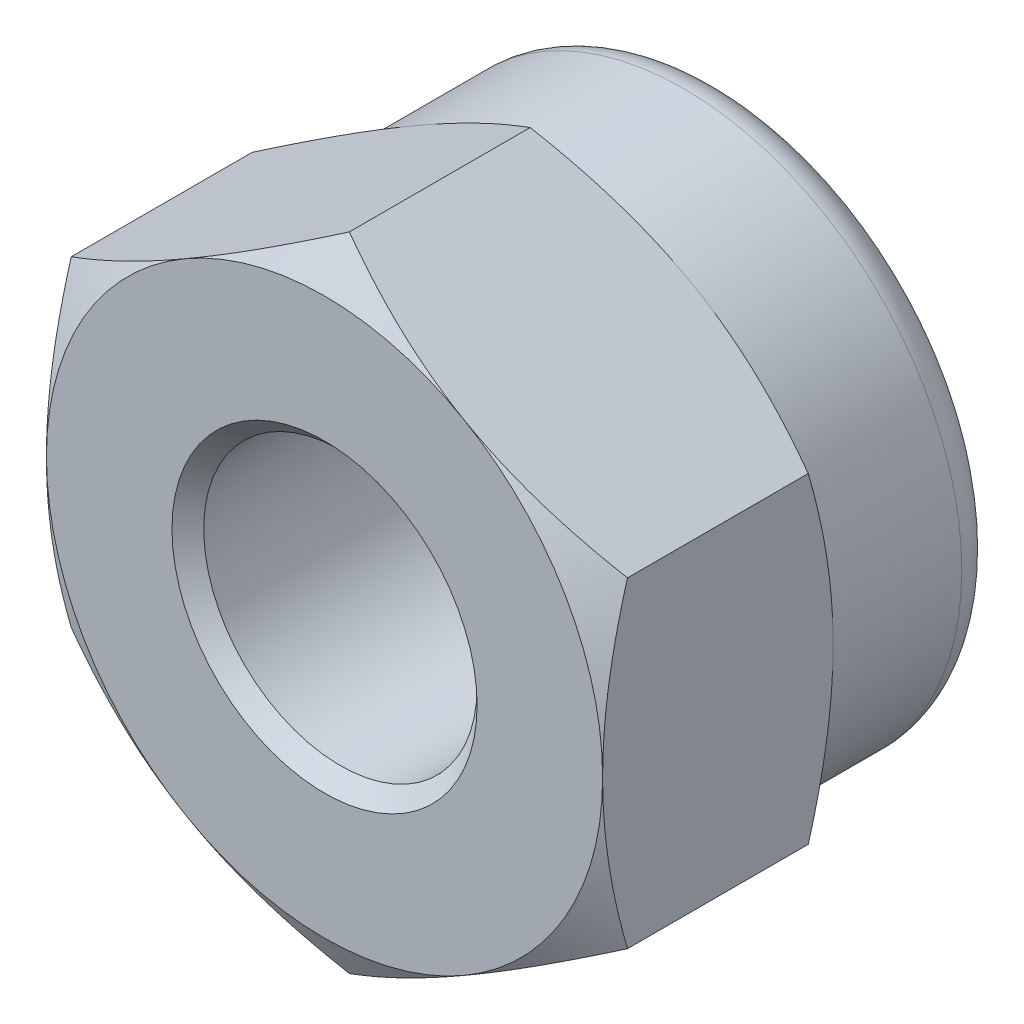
ISO-10303-21;
HEADER;
FILE_DESCRIPTION(('STEP AP214'),'2;1');
FILE_NAME('part.step','',(''),(''),'','','');
FILE_SCHEMA(('AUTOMOTIVE_DESIGN { 1 0 10303 214 1 1 1 1 }'));
ENDSEC;
DATA;
#1=APPLICATION_CONTEXT('core data for automotive mechanical design processes');
#2=APPLICATION_PROTOCOL_DEFINITION('international standard','automotive_design',2000,#1);
#3=PRODUCT_CONTEXT('',#1,'mechanical');
#4=PRODUCT('Part','Part','',(#3));
#5=PRODUCT_RELATED_PRODUCT_CATEGORY('part','',(#4));
#6=PRODUCT_DEFINITION_FORMATION('','',#4);
#7=PRODUCT_DEFINITION_CONTEXT('part definition',#1,'design');
#8=PRODUCT_DEFINITION('design','',#6,#7);
#9=PRODUCT_DEFINITION_SHAPE('','',#8);
#10=(LENGTH_UNIT() NAMED_UNIT(*) SI_UNIT(.MILLI.,.METRE.));
#11=(NAMED_UNIT(*) PLANE_ANGLE_UNIT() SI_UNIT($,.RADIAN.));
#12=(NAMED_UNIT(*) SI_UNIT($,.STERADIAN.) SOLID_ANGLE_UNIT());
#13=UNCERTAINTY_MEASURE_WITH_UNIT(LENGTH_MEASURE(1.E-05),#10,'distance_accuracy_value','');
#14=(GEOMETRIC_REPRESENTATION_CONTEXT(3) GLOBAL_UNCERTAINTY_ASSIGNED_CONTEXT((#13)) GLOBAL_UNIT_ASSIGNED_CONTEXT((#10,
#11,#12)) REPRESENTATION_CONTEXT('',''));
#15=CARTESIAN_POINT('',(0.,0.,0.));
#16=DIRECTION('',(0.,0.,1.));
#17=DIRECTION('',(1.,0.,0.));
#18=AXIS2_PLACEMENT_3D('',#15,#16,#17);
#19=CARTESIAN_POINT('',(0.,0.,-5.));
#20=DIRECTION('',(0.,0.,1.));
#21=DIRECTION('',(1.,0.,0.));
#22=AXIS2_PLACEMENT_3D('',#19,#20,#21);
#23=CYLINDRICAL_SURFACE('',#22,2.2);
#24=CARTESIAN_POINT('',(0.,0.,-2.9));
#25=DIRECTION('',(0.,0.,-1.));
#26=DIRECTION('',(-1.,0.,0.));
#27=AXIS2_PLACEMENT_3D('',#24,#25,#26);
#28=CIRCLE('',#27,2.2);
#29=CARTESIAN_POINT('',(-2.2,0.,-2.9));
#30=VERTEX_POINT('',#29);
#31=EDGE_CURVE('E324',#30,#30,#28,.T.);
#32=ORIENTED_EDGE('',*,*,#31,.F.);
#33=EDGE_LOOP('',(#32));
#34=FACE_BOUND('',#33,.T.);
#35=CARTESIAN_POINT('',(0.,0.,-4.475));
#36=DIRECTION('',(0.,0.,-1.));
#37=DIRECTION('',(-1.,0.,0.));
#38=AXIS2_PLACEMENT_3D('',#35,#36,#37);
#39=CIRCLE('',#38,2.2);
#40=CARTESIAN_POINT('',(-2.2,0.,-4.475));
#41=VERTEX_POINT('',#40);
#42=EDGE_CURVE('E321',#41,#41,#39,.T.);
#43=ORIENTED_EDGE('',*,*,#42,.T.);
#44=EDGE_LOOP('',(#43));
#45=FACE_BOUND('',#44,.T.);
#46=ADVANCED_FACE('F40',(#34,#45),#23,.F.);
#47=CARTESIAN_POINT('',(3.5,2.02072594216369,-2.9));
#48=DIRECTION('',(0.5,0.866025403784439,0.));
#49=DIRECTION('',(-0.866025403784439,0.5,0.));
#50=AXIS2_PLACEMENT_3D('',#47,#48,#49);
#51=PLANE('',#50);
#52=DIRECTION('',(0.,0.,1.));
#53=VECTOR('',#52,1.);
#54=CARTESIAN_POINT('',(3.5,2.02072594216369,-2.9));
#55=LINE('',#54,#53);
#56=CARTESIAN_POINT('',(3.5,2.02072594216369,-2.58739260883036));
#57=VERTEX_POINT('',#56);
#58=CARTESIAN_POINT('',(3.5,2.02072594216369,-0.312607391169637));
#59=VERTEX_POINT('',#58);
#60=EDGE_CURVE('E500',#57,#59,#55,.T.);
#61=ORIENTED_EDGE('',*,*,#60,.F.);
#62=CARTESIAN_POINT('',(3.5002,2.02061047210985,-2.58732593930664));
#63=CARTESIAN_POINT('',(3.34639282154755,2.10941108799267,-2.63861421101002));
#64=CARTESIAN_POINT('',(3.19125798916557,2.19897822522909,-2.68525904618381));
#65=CARTESIAN_POINT('',(2.87830199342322,2.37966345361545,-2.76667812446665));
#66=CARTESIAN_POINT('',(2.7204752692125,2.47078475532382,-2.80142356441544));
#67=CARTESIAN_POINT('',(2.40677778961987,2.65189807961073,-2.85550997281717));
#68=CARTESIAN_POINT('',(2.25095530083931,2.74186223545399,-2.87521091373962));
#69=CARTESIAN_POINT('',(1.93857711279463,2.92221386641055,-2.89872986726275));
#70=CARTESIAN_POINT('',(1.78202254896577,3.01260068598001,-2.90256735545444));
#71=CARTESIAN_POINT('',(1.48949078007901,3.18149398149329,-2.89458469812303));
#72=CARTESIAN_POINT('',(1.35346978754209,3.26002573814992,-2.8847245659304));
#73=CARTESIAN_POINT('',(1.08231397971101,3.41657761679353,-2.8534735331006));
#74=CARTESIAN_POINT('',(0.947180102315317,3.49459719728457,-2.83207195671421));
#75=CARTESIAN_POINT('',(0.675465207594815,3.65147186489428,-2.77856959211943));
#76=CARTESIAN_POINT('',(0.538918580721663,3.73030709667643,-2.74624200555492));
#77=CARTESIAN_POINT('',(0.267861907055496,3.88680174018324,-2.67287106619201));
#78=CARTESIAN_POINT('',(0.133348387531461,3.96446315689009,-2.63184495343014));
#79=CARTESIAN_POINT('',(-0.0002000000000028,4.04156735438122,-2.58732593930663));
#80=B_SPLINE_CURVE_WITH_KNOTS('',3,(#62,#63,#64,#65,#66,#67,#68,#69,#70,#71,#72,#73,#74,#75,#76,
#77,#78,#79),.UNSPECIFIED.,.F.,.F.,(4,2,2,2,2,2,2,2,4),(0.,0.554793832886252,1.11092123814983,
1.65328467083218,2.19498204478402,2.66665130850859,3.13875761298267,3.62133612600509,
4.10296698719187),.UNSPECIFIED.);
#81=CARTESIAN_POINT('',(1.75,3.03108891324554,-2.9));
#82=VERTEX_POINT('',#81);
#83=EDGE_CURVE('E145',#57,#82,#80,.T.);
#84=ORIENTED_EDGE('',*,*,#83,.T.);
#85=CARTESIAN_POINT('',(0.,4.04145188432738,-2.58739260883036));
#86=VERTEX_POINT('',#85);
#87=EDGE_CURVE('E153',#82,#86,#80,.T.);
#88=ORIENTED_EDGE('',*,*,#87,.T.);
#89=DIRECTION('',(0.,0.,1.));
#90=VECTOR('',#89,1.);
#91=CARTESIAN_POINT('',(0.,4.04145188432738,-2.9));
#92=LINE('',#91,#90);
#93=CARTESIAN_POINT('',(0.,4.04145188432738,-0.312607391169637));
#94=VERTEX_POINT('',#93);
#95=EDGE_CURVE('E505',#86,#94,#92,.T.);
#96=ORIENTED_EDGE('',*,*,#95,.T.);
#97=CARTESIAN_POINT('',(-0.00020000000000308,4.04156735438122,-0.312674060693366));
#98=CARTESIAN_POINT('',(0.153607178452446,3.9527667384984,-0.261385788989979));
#99=CARTESIAN_POINT('',(0.30874201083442,3.86319960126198,-0.214740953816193));
#100=CARTESIAN_POINT('',(0.621698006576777,3.68251437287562,-0.133321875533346));
#101=CARTESIAN_POINT('',(0.779524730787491,3.59139307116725,-0.098576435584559));
#102=CARTESIAN_POINT('',(1.09322221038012,3.41027974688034,-0.0444900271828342));
#103=CARTESIAN_POINT('',(1.24904469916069,3.32031559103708,-0.0247890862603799));
#104=CARTESIAN_POINT('',(1.56142288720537,3.13996396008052,-0.00127013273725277));
#105=CARTESIAN_POINT('',(1.71797745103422,3.04957714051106,0.0025673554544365));
#106=CARTESIAN_POINT('',(2.01050921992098,2.88068384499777,-0.00541530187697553));
#107=CARTESIAN_POINT('',(2.1465302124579,2.80215208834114,-0.0152754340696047));
#108=CARTESIAN_POINT('',(2.41768602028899,2.64560020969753,-0.0465264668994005));
#109=CARTESIAN_POINT('',(2.55281989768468,2.5675806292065,-0.0679280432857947));
#110=CARTESIAN_POINT('',(2.82453479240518,2.41070596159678,-0.121430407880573));
#111=CARTESIAN_POINT('',(2.96108141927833,2.33187072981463,-0.153757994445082));
#112=CARTESIAN_POINT('',(3.2321380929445,2.17537608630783,-0.227128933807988));
#113=CARTESIAN_POINT('',(3.36665161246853,2.09771466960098,-0.26815504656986));
#114=CARTESIAN_POINT('',(3.5002,2.02061047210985,-0.312674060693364));
#115=B_SPLINE_CURVE_WITH_KNOTS('',3,(#97,#98,#99,#100,#101,#102,#103,#104,#105,#106,#107,#108,
#109,#110,#111,#112,#113,#114),.UNSPECIFIED.,.F.,.F.,(4,2,2,2,2,2,2,2,4),(0.,0.554793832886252,
1.11092123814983,1.65328467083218,2.19498204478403,2.66665130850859,3.13875761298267,
3.62133612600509,4.10296698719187),.UNSPECIFIED.);
#116=CARTESIAN_POINT('',(1.75,3.03108891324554,0.));
#117=VERTEX_POINT('',#116);
#118=EDGE_CURVE('E504',#94,#117,#115,.T.);
#119=ORIENTED_EDGE('',*,*,#118,.T.);
#120=EDGE_CURVE('E241',#117,#59,#115,.T.);
#121=ORIENTED_EDGE('',*,*,#120,.T.);
#122=EDGE_LOOP('',(#61,#84,#88,#96,#119,#121));
#123=FACE_BOUND('',#122,.T.);
#124=ADVANCED_FACE('F252',(#123),#51,.T.);
#125=CARTESIAN_POINT('',(3.5,-2.02072594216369,-2.9));
#126=DIRECTION('',(1.,0.,0.));
#127=DIRECTION('',(0.,1.,0.));
#128=AXIS2_PLACEMENT_3D('',#125,#126,#127);
#129=PLANE('',#128);
#130=DIRECTION('',(0.,0.,1.));
#131=VECTOR('',#130,1.);
#132=CARTESIAN_POINT('',(3.5,-2.02072594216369,-2.9));
#133=LINE('',#132,#131);
#134=CARTESIAN_POINT('',(3.5,-2.02072594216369,-2.58739260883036));
#135=VERTEX_POINT('',#134);
#136=CARTESIAN_POINT('',(3.5,-2.02072594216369,-0.312607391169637));
#137=VERTEX_POINT('',#136);
#138=EDGE_CURVE('E301',#135,#137,#133,.T.);
#139=ORIENTED_EDGE('',*,*,#138,.F.);
#140=CARTESIAN_POINT('',(3.5,-5.35926424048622,-1.22515592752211));
#141=CARTESIAN_POINT('',(3.5,-5.20559440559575,-1.29941768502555));
#142=CARTESIAN_POINT('',(3.5,-5.05156124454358,-1.37294121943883));
#143=CARTESIAN_POINT('',(3.5,-4.74257181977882,-1.51808999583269));
#144=CARTESIAN_POINT('',(3.5,-4.58761540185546,-1.58971490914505));
#145=CARTESIAN_POINT('',(3.5,-4.27574595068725,-1.73102192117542));
#146=CARTESIAN_POINT('',(3.5,-4.11882679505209,-1.80069055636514));
#147=CARTESIAN_POINT('',(3.5,-3.80369874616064,-1.93703539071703));
#148=CARTESIAN_POINT('',(3.5,-3.64548992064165,-2.00371174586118));
#149=CARTESIAN_POINT('',(3.5,-3.32556686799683,-2.13406790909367));
#150=CARTESIAN_POINT('',(3.5,-3.16383345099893,-2.19770087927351));
#151=CARTESIAN_POINT('',(3.5,-2.83845895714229,-2.3199830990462));
#152=CARTESIAN_POINT('',(3.5,-2.67481767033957,-2.37863179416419));
#153=CARTESIAN_POINT('',(3.5,-2.34570319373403,-2.48936958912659));
#154=CARTESIAN_POINT('',(3.5,-2.18023474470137,-2.54147263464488));
#155=CARTESIAN_POINT('',(3.5,-1.84694549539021,-2.63742699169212));
#156=CARTESIAN_POINT('',(3.5,-1.67912545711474,-2.68128091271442));
#157=CARTESIAN_POINT('',(3.5,-1.34101838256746,-2.75860803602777));
#158=CARTESIAN_POINT('',(3.5,-1.17073070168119,-2.79207847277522));
#159=CARTESIAN_POINT('',(3.5,-0.828102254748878,-2.84638506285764));
#160=CARTESIAN_POINT('',(3.5,-0.655761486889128,-2.86722120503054));
#161=CARTESIAN_POINT('',(3.5,-0.311020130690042,-2.89441593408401));
#162=CARTESIAN_POINT('',(3.5,-0.138626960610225,-2.90086617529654));
#163=CARTESIAN_POINT('',(3.5,0.206038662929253,-2.89894642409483));
#164=CARTESIAN_POINT('',(3.5,0.378311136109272,-2.89058027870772));
#165=CARTESIAN_POINT('',(3.5,0.672491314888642,-2.86423102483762));
#166=CARTESIAN_POINT('',(3.5,0.794723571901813,-2.84967926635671));
#167=CARTESIAN_POINT('',(3.5,1.03824387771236,-2.81406313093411));
#168=CARTESIAN_POINT('',(3.5,1.15953177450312,-2.79299772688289));
#169=CARTESIAN_POINT('',(3.5,1.52188005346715,-2.72113660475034));
#170=CARTESIAN_POINT('',(3.5,1.76124198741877,-2.6616944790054));
#171=CARTESIAN_POINT('',(3.5,2.11941071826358,-2.55917288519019));
#172=CARTESIAN_POINT('',(3.5,2.24008446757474,-2.52224998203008));
#173=CARTESIAN_POINT('',(3.5,2.48017245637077,-2.44475063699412));
#174=CARTESIAN_POINT('',(3.5,2.59958750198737,-2.40417671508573));
#175=CARTESIAN_POINT('',(3.5,2.8366587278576,-2.32021960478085));
#176=CARTESIAN_POINT('',(3.5,2.95432102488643,-2.27685351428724));
#177=CARTESIAN_POINT('',(3.5,3.18873271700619,-2.18757598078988));
#178=CARTESIAN_POINT('',(3.5,3.30548172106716,-2.1416635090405));
#179=CARTESIAN_POINT('',(3.5,3.42180858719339,-2.09472912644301));
#180=B_SPLINE_CURVE_WITH_KNOTS('',3,(#140,#141,#142,#143,#144,#145,#146,#147,#148,#149,#150,
#151,#152,#153,#154,#155,#156,#157,#158,#159,#160,#161,#162,#163,#164,#165,#166,#167,#168,#169,
#170,#171,#172,#173,#174,#175,#176,#177,#178,#179),.UNSPECIFIED.,.F.,.F.,(4,2,2,2,2,2,2,2,2,2,2,
2,2,2,2,2,2,2,2,4),(0.,0.512025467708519,1.02413900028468,1.53918315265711,2.05420042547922,
2.57554051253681,3.09693852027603,3.61720612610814,4.13730887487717,4.65755002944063,
5.17779164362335,5.69470915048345,6.21149246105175,6.58059842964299,6.94976263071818,
7.68864045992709,8.06719870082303,8.44549763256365,8.82166724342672,9.19798995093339),.UNSPECIFIED.);
#181=CARTESIAN_POINT('',(3.5,0.,-2.9));
#182=VERTEX_POINT('',#181);
#183=EDGE_CURVE('E265',#135,#182,#180,.T.);
#184=ORIENTED_EDGE('',*,*,#183,.T.);
#185=EDGE_CURVE('E258',#182,#57,#180,.T.);
#186=ORIENTED_EDGE('',*,*,#185,.T.);
#187=ORIENTED_EDGE('',*,*,#60,.T.);
#188=CARTESIAN_POINT('',(3.5,-5.35926299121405,-1.67484346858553));
#189=CARTESIAN_POINT('',(3.5,-5.20559319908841,-1.60058173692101));
#190=CARTESIAN_POINT('',(3.5,-5.05156008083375,-1.52705822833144));
#191=CARTESIAN_POINT('',(3.5,-4.7425707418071,-1.38190950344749));
#192=CARTESIAN_POINT('',(3.5,-4.58761436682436,-1.3102846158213));
#193=CARTESIAN_POINT('',(3.5,-4.27574500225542,-1.16897765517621));
#194=CARTESIAN_POINT('',(3.5,-4.11882589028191,-1.09930904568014));
#195=CARTESIAN_POINT('',(3.5,-3.80369792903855,-0.962964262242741));
#196=CARTESIAN_POINT('',(3.5,-3.64548914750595,-0.896287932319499));
#197=CARTESIAN_POINT('',(3.5,-3.32556618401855,-0.765931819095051));
#198=CARTESIAN_POINT('',(3.5,-3.16383281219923,-0.70229887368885));
#199=CARTESIAN_POINT('',(3.5,-2.83845840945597,-0.58001670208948));
#200=CARTESIAN_POINT('',(3.5,-2.67481716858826,-0.52136803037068));
#201=CARTESIAN_POINT('',(3.5,-2.34570278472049,-0.410630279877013));
#202=CARTESIAN_POINT('',(3.5,-2.18023438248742,-0.35852725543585));
#203=CARTESIAN_POINT('',(3.5,-1.84694522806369,-0.262572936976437));
#204=CARTESIAN_POINT('',(3.5,-1.6791252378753,-0.218719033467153));
#205=CARTESIAN_POINT('',(3.5,-1.34101828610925,-0.141391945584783));
#206=CARTESIAN_POINT('',(3.5,-1.17073068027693,-0.10792152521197));
#207=CARTESIAN_POINT('',(3.5,-0.828102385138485,-0.0536149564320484));
#208=CARTESIAN_POINT('',(3.5,-0.655761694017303,-0.0327788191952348));
#209=CARTESIAN_POINT('',(3.5,-0.311020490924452,-0.00558408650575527));
#210=CARTESIAN_POINT('',(3.5,-0.138627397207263,0.000866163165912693));
#211=CARTESIAN_POINT('',(3.5,0.206038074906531,-0.0010535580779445));
#212=CARTESIAN_POINT('',(3.5,0.378310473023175,-0.00941968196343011));
#213=CARTESIAN_POINT('',(3.5,0.672490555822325,-0.0357688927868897));
#214=CARTESIAN_POINT('',(3.5,0.794722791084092,-0.0503206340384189));
#215=CARTESIAN_POINT('',(3.5,1.03824305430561,-0.0859367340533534));
#216=CARTESIAN_POINT('',(3.5,1.15953093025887,-0.107002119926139));
#217=CARTESIAN_POINT('',(3.5,1.5218791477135,-0.178863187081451));
#218=CARTESIAN_POINT('',(3.5,1.76124104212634,-0.238305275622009));
#219=CARTESIAN_POINT('',(3.5,2.11940971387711,-0.340826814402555));
#220=CARTESIAN_POINT('',(3.5,2.24008344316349,-0.377749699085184));
#221=CARTESIAN_POINT('',(3.5,2.48017139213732,-0.455249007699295));
#222=CARTESIAN_POINT('',(3.5,2.59958641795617,-0.495822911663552));
#223=CARTESIAN_POINT('',(3.5,2.83665760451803,-0.579779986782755));
#224=CARTESIAN_POINT('',(3.5,2.95431988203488,-0.623146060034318));
#225=CARTESIAN_POINT('',(3.5,3.18873153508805,-0.71242355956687));
#226=CARTESIAN_POINT('',(3.5,3.30548051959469,-0.758336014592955));
#227=CARTESIAN_POINT('',(3.5,3.42180736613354,-0.805270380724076));
#228=B_SPLINE_CURVE_WITH_KNOTS('',3,(#188,#189,#190,#191,#192,#193,#194,#195,#196,#197,#198,
#199,#200,#201,#202,#203,#204,#205,#206,#207,#208,#209,#210,#211,#212,#213,#214,#215,#216,#217,
#218,#219,#220,#221,#222,#223,#224,#225,#226,#227),.UNSPECIFIED.,.F.,.F.,(4,2,2,2,2,2,2,2,2,2,2,
2,2,2,2,2,2,2,2,4),(0.,0.512025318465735,1.02413870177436,1.53918270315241,2.05419982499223,
2.57553975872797,3.09693761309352,3.61720506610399,4.13730766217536,4.65754858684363,
5.17778997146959,5.6947072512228,6.21149033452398,6.5805962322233,6.94976036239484,
7.68863804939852,8.0671962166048,8.44549507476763,8.82166461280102,9.19798724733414),.UNSPECIFIED.);
#229=CARTESIAN_POINT('',(3.5,0.,0.));
#230=VERTEX_POINT('',#229);
#231=EDGE_CURVE('E239',#59,#230,#228,.F.);
#232=ORIENTED_EDGE('',*,*,#231,.T.);
#233=EDGE_CURVE('E232',#230,#137,#228,.F.);
#234=ORIENTED_EDGE('',*,*,#233,.T.);
#235=EDGE_LOOP('',(#139,#184,#186,#187,#232,#234));
#236=FACE_BOUND('',#235,.T.);
#237=ADVANCED_FACE('F247',(#236),#129,.T.);
#238=CARTESIAN_POINT('',(0.,-4.04145188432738,-2.9));
#239=DIRECTION('',(0.5,-0.866025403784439,0.));
#240=DIRECTION('',(0.866025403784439,0.5,0.));
#241=AXIS2_PLACEMENT_3D('',#238,#239,#240);
#242=PLANE('',#241);
#243=DIRECTION('',(0.,0.,1.));
#244=VECTOR('',#243,1.);
#245=CARTESIAN_POINT('',(0.,-4.04145188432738,-2.9));
#246=LINE('',#245,#244);
#247=CARTESIAN_POINT('',(0.,-4.04145188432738,-2.58739260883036));
#248=VERTEX_POINT('',#247);
#249=CARTESIAN_POINT('',(0.,-4.04145188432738,-0.312607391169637));
#250=VERTEX_POINT('',#249);
#251=EDGE_CURVE('E291',#248,#250,#246,.T.);
#252=ORIENTED_EDGE('',*,*,#251,.F.);
#253=CARTESIAN_POINT('',(-0.000199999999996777,-4.04156735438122,-2.58732593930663));
#254=CARTESIAN_POINT('',(0.153607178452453,-3.9527667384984,-2.63861421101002));
#255=CARTESIAN_POINT('',(0.308742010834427,-3.86319960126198,-2.68525904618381));
#256=CARTESIAN_POINT('',(0.621698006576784,-3.68251437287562,-2.76667812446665));
#257=CARTESIAN_POINT('',(0.779524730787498,-3.59139307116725,-2.80142356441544));
#258=CARTESIAN_POINT('',(1.09322221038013,-3.41027974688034,-2.85550997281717));
#259=CARTESIAN_POINT('',(1.24904469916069,-3.32031559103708,-2.87521091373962));
#260=CARTESIAN_POINT('',(1.56142288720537,-3.13996396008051,-2.89872986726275));
#261=CARTESIAN_POINT('',(1.71797745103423,-3.04957714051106,-2.90256735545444));
#262=CARTESIAN_POINT('',(2.01050921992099,-2.88068384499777,-2.89458469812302));
#263=CARTESIAN_POINT('',(2.14653021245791,-2.80215208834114,-2.88472456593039));
#264=CARTESIAN_POINT('',(2.41768602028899,-2.64560020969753,-2.8534735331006));
#265=CARTESIAN_POINT('',(2.55281989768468,-2.5675806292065,-2.8320719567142));
#266=CARTESIAN_POINT('',(2.82453479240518,-2.41070596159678,-2.77856959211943));
#267=CARTESIAN_POINT('',(2.96108141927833,-2.33187072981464,-2.74624200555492));
#268=CARTESIAN_POINT('',(3.2321380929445,-2.17537608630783,-2.67287106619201));
#269=CARTESIAN_POINT('',(3.36665161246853,-2.09771466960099,-2.63184495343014));
#270=CARTESIAN_POINT('',(3.5002,-2.02061047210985,-2.58732593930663));
#271=B_SPLINE_CURVE_WITH_KNOTS('',3,(#253,#254,#255,#256,#257,#258,#259,#260,#261,#262,#263,
#264,#265,#266,#267,#268,#269,#270),.UNSPECIFIED.,.F.,.F.,(4,2,2,2,2,2,2,2,4),(0.,
0.554793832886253,1.11092123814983,1.65328467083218,2.19498204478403,2.66665130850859,
3.13875761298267,3.62133612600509,4.10296698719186),.UNSPECIFIED.);
#272=CARTESIAN_POINT('',(1.75,-3.03108891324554,-2.9));
#273=VERTEX_POINT('',#272);
#274=EDGE_CURVE('E276',#248,#273,#271,.T.);
#275=ORIENTED_EDGE('',*,*,#274,.T.);
#276=EDGE_CURVE('E270',#273,#135,#271,.T.);
#277=ORIENTED_EDGE('',*,*,#276,.T.);
#278=ORIENTED_EDGE('',*,*,#138,.T.);
#279=CARTESIAN_POINT('',(3.5002,-2.02061047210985,-0.312674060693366));
#280=CARTESIAN_POINT('',(3.34639282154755,-2.10941108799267,-0.261385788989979));
#281=CARTESIAN_POINT('',(3.19125798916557,-2.19897822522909,-0.214740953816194));
#282=CARTESIAN_POINT('',(2.87830199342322,-2.37966345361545,-0.133321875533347));
#283=CARTESIAN_POINT('',(2.7204752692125,-2.47078475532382,-0.0985764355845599));
#284=CARTESIAN_POINT('',(2.40677778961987,-2.65189807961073,-0.0444900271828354));
#285=CARTESIAN_POINT('',(2.25095530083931,-2.74186223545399,-0.0247890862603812));
#286=CARTESIAN_POINT('',(1.93857711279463,-2.92221386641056,-0.00127013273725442));
#287=CARTESIAN_POINT('',(1.78202254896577,-3.01260068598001,0.00256735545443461));
#288=CARTESIAN_POINT('',(1.48949078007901,-3.1814939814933,-0.00541530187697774));
#289=CARTESIAN_POINT('',(1.3534697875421,-3.26002573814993,-0.015275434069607));
#290=CARTESIAN_POINT('',(1.08231397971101,-3.41657761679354,-0.0465264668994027));
#291=CARTESIAN_POINT('',(0.947180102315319,-3.49459719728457,-0.0679280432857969));
#292=CARTESIAN_POINT('',(0.675465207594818,-3.65147186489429,-0.121430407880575));
#293=CARTESIAN_POINT('',(0.538918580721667,-3.73030709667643,-0.153757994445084));
#294=CARTESIAN_POINT('',(0.267861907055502,-3.88680174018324,-0.22712893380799));
#295=CARTESIAN_POINT('',(0.133348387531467,-3.96446315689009,-0.268155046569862));
#296=CARTESIAN_POINT('',(-0.000199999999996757,-4.04156735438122,-0.312674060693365));
#297=B_SPLINE_CURVE_WITH_KNOTS('',3,(#279,#280,#281,#282,#283,#284,#285,#286,#287,#288,#289,
#290,#291,#292,#293,#294,#295,#296),.UNSPECIFIED.,.F.,.F.,(4,2,2,2,2,2,2,2,4),(0.,
0.554793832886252,1.11092123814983,1.65328467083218,2.19498204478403,2.66665130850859,
3.13875761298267,3.62133612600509,4.10296698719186),.UNSPECIFIED.);
#298=CARTESIAN_POINT('',(1.75,-3.03108891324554,0.));
#299=VERTEX_POINT('',#298);
#300=EDGE_CURVE('E240',#137,#299,#297,.T.);
#301=ORIENTED_EDGE('',*,*,#300,.T.);
#302=EDGE_CURVE('E226',#299,#250,#297,.T.);
#303=ORIENTED_EDGE('',*,*,#302,.T.);
#304=EDGE_LOOP('',(#252,#275,#277,#278,#301,#303));
#305=FACE_BOUND('',#304,.T.);
#306=ADVANCED_FACE('F251',(#305),#242,.T.);
#307=CARTESIAN_POINT('',(-3.5,-2.02072594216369,-2.9));
#308=DIRECTION('',(-0.5,-0.866025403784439,0.));
#309=DIRECTION('',(0.866025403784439,-0.5,0.));
#310=AXIS2_PLACEMENT_3D('',#307,#308,#309);
#311=PLANE('',#310);
#312=DIRECTION('',(0.,0.,1.));
#313=VECTOR('',#312,1.);
#314=CARTESIAN_POINT('',(-3.5,-2.02072594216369,-2.9));
#315=LINE('',#314,#313);
#316=CARTESIAN_POINT('',(-3.5,-2.02072594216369,-2.58739260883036));
#317=VERTEX_POINT('',#316);
#318=CARTESIAN_POINT('',(-3.5,-2.02072594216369,-0.312607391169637));
#319=VERTEX_POINT('',#318);
#320=EDGE_CURVE('E509',#317,#319,#315,.T.);
#321=ORIENTED_EDGE('',*,*,#320,.F.);
#322=CARTESIAN_POINT('',(-3.5002,-2.02061047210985,-2.58732593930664));
#323=CARTESIAN_POINT('',(-3.34639282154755,-2.10941108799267,-2.63861421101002));
#324=CARTESIAN_POINT('',(-3.19125798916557,-2.19897822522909,-2.68525904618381));
#325=CARTESIAN_POINT('',(-2.87830199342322,-2.37966345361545,-2.76667812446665));
#326=CARTESIAN_POINT('',(-2.7204752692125,-2.47078475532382,-2.80142356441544));
#327=CARTESIAN_POINT('',(-2.40677778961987,-2.65189807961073,-2.85550997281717));
#328=CARTESIAN_POINT('',(-2.25095530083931,-2.74186223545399,-2.87521091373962));
#329=CARTESIAN_POINT('',(-1.93857711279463,-2.92221386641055,-2.89872986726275));
#330=CARTESIAN_POINT('',(-1.78202254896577,-3.01260068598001,-2.90256735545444));
#331=CARTESIAN_POINT('',(-1.48949078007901,-3.18149398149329,-2.89458469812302));
#332=CARTESIAN_POINT('',(-1.35346978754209,-3.26002573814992,-2.88472456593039));
#333=CARTESIAN_POINT('',(-1.082313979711,-3.41657761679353,-2.8534735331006));
#334=CARTESIAN_POINT('',(-0.947180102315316,-3.49459719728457,-2.8320719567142));
#335=CARTESIAN_POINT('',(-0.675465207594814,-3.65147186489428,-2.77856959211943));
#336=CARTESIAN_POINT('',(-0.538918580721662,-3.73030709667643,-2.74624200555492));
#337=CARTESIAN_POINT('',(-0.267861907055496,-3.88680174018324,-2.67287106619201));
#338=CARTESIAN_POINT('',(-0.13334838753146,-3.96446315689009,-2.63184495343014));
#339=CARTESIAN_POINT('',(0.000200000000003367,-4.04156735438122,-2.58732593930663));
#340=B_SPLINE_CURVE_WITH_KNOTS('',3,(#322,#323,#324,#325,#326,#327,#328,#329,#330,#331,#332,
#333,#334,#335,#336,#337,#338,#339),.UNSPECIFIED.,.F.,.F.,(4,2,2,2,2,2,2,2,4),(0.,
0.554793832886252,1.11092123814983,1.65328467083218,2.19498204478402,2.66665130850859,
3.13875761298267,3.62133612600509,4.10296698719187),.UNSPECIFIED.);
#341=CARTESIAN_POINT('',(-1.75,-3.03108891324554,-2.9));
#342=VERTEX_POINT('',#341);
#343=EDGE_CURVE('E142',#317,#342,#340,.T.);
#344=ORIENTED_EDGE('',*,*,#343,.T.);
#345=EDGE_CURVE('E277',#342,#248,#340,.T.);
#346=ORIENTED_EDGE('',*,*,#345,.T.);
#347=ORIENTED_EDGE('',*,*,#251,.T.);
#348=CARTESIAN_POINT('',(0.00020000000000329,-4.04156735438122,-0.312674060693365));
#349=CARTESIAN_POINT('',(-0.153607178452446,-3.9527667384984,-0.261385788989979));
#350=CARTESIAN_POINT('',(-0.30874201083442,-3.86319960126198,-0.214740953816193));
#351=CARTESIAN_POINT('',(-0.621698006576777,-3.68251437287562,-0.133321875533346));
#352=CARTESIAN_POINT('',(-0.779524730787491,-3.59139307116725,-0.0985764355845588));
#353=CARTESIAN_POINT('',(-1.09322221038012,-3.41027974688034,-0.0444900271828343));
#354=CARTESIAN_POINT('',(-1.24904469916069,-3.32031559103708,-0.02478908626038));
#355=CARTESIAN_POINT('',(-1.56142288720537,-3.13996396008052,-0.0012701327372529));
#356=CARTESIAN_POINT('',(-1.71797745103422,-3.04957714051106,0.00256735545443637));
#357=CARTESIAN_POINT('',(-2.01050921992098,-2.88068384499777,-0.00541530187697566));
#358=CARTESIAN_POINT('',(-2.1465302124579,-2.80215208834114,-0.0152754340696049));
#359=CARTESIAN_POINT('',(-2.41768602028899,-2.64560020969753,-0.0465264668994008));
#360=CARTESIAN_POINT('',(-2.55281989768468,-2.5675806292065,-0.0679280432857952));
#361=CARTESIAN_POINT('',(-2.82453479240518,-2.41070596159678,-0.121430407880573));
#362=CARTESIAN_POINT('',(-2.96108141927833,-2.33187072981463,-0.153757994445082));
#363=CARTESIAN_POINT('',(-3.2321380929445,-2.17537608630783,-0.227128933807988));
#364=CARTESIAN_POINT('',(-3.36665161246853,-2.09771466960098,-0.26815504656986));
#365=CARTESIAN_POINT('',(-3.5002,-2.02061047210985,-0.312674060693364));
#366=B_SPLINE_CURVE_WITH_KNOTS('',3,(#348,#349,#350,#351,#352,#353,#354,#355,#356,#357,#358,
#359,#360,#361,#362,#363,#364,#365),.UNSPECIFIED.,.F.,.F.,(4,2,2,2,2,2,2,2,4),(0.,
0.554793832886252,1.11092123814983,1.65328467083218,2.19498204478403,2.66665130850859,
3.13875761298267,3.62133612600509,4.10296698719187),.UNSPECIFIED.);
#367=CARTESIAN_POINT('',(-1.75,-3.03108891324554,0.));
#368=VERTEX_POINT('',#367);
#369=EDGE_CURVE('E514',#250,#368,#366,.T.);
#370=ORIENTED_EDGE('',*,*,#369,.T.);
#371=EDGE_CURVE('E205',#368,#319,#366,.T.);
#372=ORIENTED_EDGE('',*,*,#371,.T.);
#373=EDGE_LOOP('',(#321,#344,#346,#347,#370,#372));
#374=FACE_BOUND('',#373,.T.);
#375=ADVANCED_FACE('F184',(#374),#311,.T.);
#376=CARTESIAN_POINT('',(-3.5,2.02072594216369,-2.9));
#377=DIRECTION('',(-1.,0.,0.));
#378=DIRECTION('',(0.,-1.,0.));
#379=AXIS2_PLACEMENT_3D('',#376,#377,#378);
#380=PLANE('',#379);
#381=DIRECTION('',(0.,0.,1.));
#382=VECTOR('',#381,1.);
#383=CARTESIAN_POINT('',(-3.5,2.02072594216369,-2.9));
#384=LINE('',#383,#382);
#385=CARTESIAN_POINT('',(-3.5,2.02072594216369,-2.58739260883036));
#386=VERTEX_POINT('',#385);
#387=CARTESIAN_POINT('',(-3.5,2.02072594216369,-0.312607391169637));
#388=VERTEX_POINT('',#387);
#389=EDGE_CURVE('E152',#386,#388,#384,.T.);
#390=ORIENTED_EDGE('',*,*,#389,.F.);
#391=CARTESIAN_POINT('',(-3.49999999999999,-5.35926299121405,-1.22515653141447));
#392=CARTESIAN_POINT('',(-3.49999999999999,-5.20559319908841,-1.29941826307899));
#393=CARTESIAN_POINT('',(-3.49999999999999,-5.05156008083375,-1.37294177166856));
#394=CARTESIAN_POINT('',(-3.49999999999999,-4.74257074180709,-1.51809049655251));
#395=CARTESIAN_POINT('',(-3.5,-4.58761436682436,-1.5897153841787));
#396=CARTESIAN_POINT('',(-3.5,-4.27574500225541,-1.73102234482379));
#397=CARTESIAN_POINT('',(-3.5,-4.11882589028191,-1.80069095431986));
#398=CARTESIAN_POINT('',(-3.5,-3.80369792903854,-1.93703573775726));
#399=CARTESIAN_POINT('',(-3.5,-3.64548914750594,-2.0037120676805));
#400=CARTESIAN_POINT('',(-3.5,-3.32556618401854,-2.13406818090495));
#401=CARTESIAN_POINT('',(-3.5,-3.16383281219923,-2.19770112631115));
#402=CARTESIAN_POINT('',(-3.5,-2.83845840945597,-2.31998329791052));
#403=CARTESIAN_POINT('',(-3.5,-2.67481716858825,-2.37863196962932));
#404=CARTESIAN_POINT('',(-3.5,-2.34570278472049,-2.48936972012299));
#405=CARTESIAN_POINT('',(-3.5,-2.18023438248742,-2.54147274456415));
#406=CARTESIAN_POINT('',(-3.5,-1.84694522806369,-2.63742706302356));
#407=CARTESIAN_POINT('',(-3.5,-1.6791252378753,-2.68128096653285));
#408=CARTESIAN_POINT('',(-3.5,-1.34101828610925,-2.75860805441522));
#409=CARTESIAN_POINT('',(-3.5,-1.17073068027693,-2.79207847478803));
#410=CARTESIAN_POINT('',(-3.5,-0.828102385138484,-2.84638504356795));
#411=CARTESIAN_POINT('',(-3.5,-0.655761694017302,-2.86722118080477));
#412=CARTESIAN_POINT('',(-3.5,-0.311020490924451,-2.89441591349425));
#413=CARTESIAN_POINT('',(-3.5,-0.138627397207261,-2.90086616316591));
#414=CARTESIAN_POINT('',(-3.5,0.206038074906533,-2.89894644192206));
#415=CARTESIAN_POINT('',(-3.5,0.378310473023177,-2.89058031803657));
#416=CARTESIAN_POINT('',(-3.5,0.672490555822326,-2.86423110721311));
#417=CARTESIAN_POINT('',(-3.5,0.794722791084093,-2.84967936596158));
#418=CARTESIAN_POINT('',(-3.5,1.03824305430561,-2.81406326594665));
#419=CARTESIAN_POINT('',(-3.5,1.15953093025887,-2.79299788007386));
#420=CARTESIAN_POINT('',(-3.5,1.5218791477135,-2.72113681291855));
#421=CARTESIAN_POINT('',(-3.5,1.76124104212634,-2.66169472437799));
#422=CARTESIAN_POINT('',(-3.5,2.11940971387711,-2.55917318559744));
#423=CARTESIAN_POINT('',(-3.5,2.24008344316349,-2.52225030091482));
#424=CARTESIAN_POINT('',(-3.5,2.48017139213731,-2.4447509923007));
#425=CARTESIAN_POINT('',(-3.5,2.59958641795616,-2.40417708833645));
#426=CARTESIAN_POINT('',(-3.5,2.83665760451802,-2.32022001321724));
#427=CARTESIAN_POINT('',(-3.5,2.95431988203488,-2.27685393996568));
#428=CARTESIAN_POINT('',(-3.5,3.18873153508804,-2.18757644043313));
#429=CARTESIAN_POINT('',(-3.5,3.30548051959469,-2.14166398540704));
#430=CARTESIAN_POINT('',(-3.5,3.42180736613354,-2.09472961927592));
#431=B_SPLINE_CURVE_WITH_KNOTS('',3,(#391,#392,#393,#394,#395,#396,#397,#398,#399,#400,#401,
#402,#403,#404,#405,#406,#407,#408,#409,#410,#411,#412,#413,#414,#415,#416,#417,#418,#419,#420,
#421,#422,#423,#424,#425,#426,#427,#428,#429,#430),.UNSPECIFIED.,.F.,.F.,(4,2,2,2,2,2,2,2,2,2,2,
2,2,2,2,2,2,2,2,4),(0.,0.512025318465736,1.02413870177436,1.53918270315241,2.05419982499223,
2.57553975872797,3.09693761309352,3.61720506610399,4.13730766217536,4.65754858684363,
5.17778997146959,5.6947072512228,6.21149033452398,6.5805962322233,6.94976036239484,
7.68863804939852,8.06719621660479,8.44549507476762,8.82166461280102,9.19798724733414),.UNSPECIFIED.);
#432=CARTESIAN_POINT('',(-3.5,0.,-2.9));
#433=VERTEX_POINT('',#432);
#434=EDGE_CURVE('E63',#386,#433,#431,.F.);
#435=ORIENTED_EDGE('',*,*,#434,.T.);
#436=EDGE_CURVE('E140',#433,#317,#431,.F.);
#437=ORIENTED_EDGE('',*,*,#436,.T.);
#438=ORIENTED_EDGE('',*,*,#320,.T.);
#439=CARTESIAN_POINT('',(-3.49999999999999,-5.35926424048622,-1.67484407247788));
#440=CARTESIAN_POINT('',(-3.49999999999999,-5.20559440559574,-1.60058231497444));
#441=CARTESIAN_POINT('',(-3.49999999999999,-5.05156124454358,-1.52705878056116));
#442=CARTESIAN_POINT('',(-3.49999999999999,-4.74257181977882,-1.3819100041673));
#443=CARTESIAN_POINT('',(-3.5,-4.58761540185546,-1.31028509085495));
#444=CARTESIAN_POINT('',(-3.5,-4.27574595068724,-1.16897807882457));
#445=CARTESIAN_POINT('',(-3.5,-4.11882679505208,-1.09930944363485));
#446=CARTESIAN_POINT('',(-3.5,-3.80369874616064,-0.962964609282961));
#447=CARTESIAN_POINT('',(-3.5,-3.64548992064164,-0.89628825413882));
#448=CARTESIAN_POINT('',(-3.5,-3.32556686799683,-0.765932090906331));
#449=CARTESIAN_POINT('',(-3.5,-3.16383345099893,-0.702299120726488));
#450=CARTESIAN_POINT('',(-3.5,-2.83845895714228,-0.580016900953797));
#451=CARTESIAN_POINT('',(-3.5,-2.67481767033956,-0.521368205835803));
#452=CARTESIAN_POINT('',(-3.5,-2.34570319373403,-0.410630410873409));
#453=CARTESIAN_POINT('',(-3.5,-2.18023474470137,-0.358527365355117));
#454=CARTESIAN_POINT('',(-3.5,-1.84694549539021,-0.26257300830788));
#455=CARTESIAN_POINT('',(-3.5,-1.67912545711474,-0.218719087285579));
#456=CARTESIAN_POINT('',(-3.5,-1.34101838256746,-0.14139196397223));
#457=CARTESIAN_POINT('',(-3.5,-1.17073070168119,-0.107921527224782));
#458=CARTESIAN_POINT('',(-3.5,-0.828102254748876,-0.0536149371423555));
#459=CARTESIAN_POINT('',(-3.5,-0.655761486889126,-0.0327787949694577));
#460=CARTESIAN_POINT('',(-3.5,-0.311020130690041,-0.00558406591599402));
#461=CARTESIAN_POINT('',(-3.5,-0.138626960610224,0.000866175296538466));
#462=CARTESIAN_POINT('',(-3.5,0.206038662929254,-0.00105357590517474));
#463=CARTESIAN_POINT('',(-3.5,0.378311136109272,-0.00941972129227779));
#464=CARTESIAN_POINT('',(-3.5,0.672491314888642,-0.0357689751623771));
#465=CARTESIAN_POINT('',(-3.5,0.794723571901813,-0.0503207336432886));
#466=CARTESIAN_POINT('',(-3.5,1.03824387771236,-0.0859368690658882));
#467=CARTESIAN_POINT('',(-3.5,1.15953177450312,-0.107002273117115));
#468=CARTESIAN_POINT('',(-3.5,1.52188005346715,-0.178863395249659));
#469=CARTESIAN_POINT('',(-3.5,1.76124198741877,-0.238305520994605));
#470=CARTESIAN_POINT('',(-3.5,2.11941071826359,-0.340827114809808));
#471=CARTESIAN_POINT('',(-3.5,2.24008446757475,-0.377750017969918));
#472=CARTESIAN_POINT('',(-3.5,2.48017245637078,-0.455249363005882));
#473=CARTESIAN_POINT('',(-3.5,2.59958750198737,-0.495823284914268));
#474=CARTESIAN_POINT('',(-3.5,2.8366587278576,-0.57978039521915));
#475=CARTESIAN_POINT('',(-3.5,2.95432102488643,-0.623146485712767));
#476=CARTESIAN_POINT('',(-3.5,3.1887327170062,-0.71242401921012));
#477=CARTESIAN_POINT('',(-3.5,3.30548172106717,-0.758336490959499));
#478=CARTESIAN_POINT('',(-3.5,3.4218085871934,-0.80527087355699));
#479=B_SPLINE_CURVE_WITH_KNOTS('',3,(#439,#440,#441,#442,#443,#444,#445,#446,#447,#448,#449,
#450,#451,#452,#453,#454,#455,#456,#457,#458,#459,#460,#461,#462,#463,#464,#465,#466,#467,#468,
#469,#470,#471,#472,#473,#474,#475,#476,#477,#478),.UNSPECIFIED.,.F.,.F.,(4,2,2,2,2,2,2,2,2,2,2,
2,2,2,2,2,2,2,2,4),(0.,0.512025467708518,1.02413900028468,1.53918315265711,2.05420042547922,
2.57554051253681,3.09693852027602,3.61720612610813,4.13730887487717,4.65755002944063,
5.17779164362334,5.69470915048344,6.21149246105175,6.58059842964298,6.94976263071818,
7.68864045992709,8.06719870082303,8.44549763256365,8.82166724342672,9.19798995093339),.UNSPECIFIED.);
#480=CARTESIAN_POINT('',(-3.5,0.,0.));
#481=VERTEX_POINT('',#480);
#482=EDGE_CURVE('E197',#319,#481,#479,.T.);
#483=ORIENTED_EDGE('',*,*,#482,.T.);
#484=EDGE_CURVE('E190',#481,#388,#479,.T.);
#485=ORIENTED_EDGE('',*,*,#484,.T.);
#486=EDGE_LOOP('',(#390,#435,#437,#438,#483,#485));
#487=FACE_BOUND('',#486,.T.);
#488=ADVANCED_FACE('F150',(#487),#380,.T.);
#489=CARTESIAN_POINT('',(0.,4.04145188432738,-2.9));
#490=DIRECTION('',(-0.5,0.866025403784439,0.));
#491=DIRECTION('',(-0.866025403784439,-0.5,0.));
#492=AXIS2_PLACEMENT_3D('',#489,#490,#491);
#493=PLANE('',#492);
#494=ORIENTED_EDGE('',*,*,#95,.F.);
#495=CARTESIAN_POINT('',(0.000199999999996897,4.04156735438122,-2.58732593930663));
#496=CARTESIAN_POINT('',(-0.153607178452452,3.9527667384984,-2.63861421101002));
#497=CARTESIAN_POINT('',(-0.308742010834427,3.86319960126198,-2.68525904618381));
#498=CARTESIAN_POINT('',(-0.621698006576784,3.68251437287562,-2.76667812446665));
#499=CARTESIAN_POINT('',(-0.779524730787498,3.59139307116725,-2.80142356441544));
#500=CARTESIAN_POINT('',(-1.09322221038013,3.41027974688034,-2.85550997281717));
#501=CARTESIAN_POINT('',(-1.24904469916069,3.32031559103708,-2.87521091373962));
#502=CARTESIAN_POINT('',(-1.56142288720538,3.13996396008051,-2.89872986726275));
#503=CARTESIAN_POINT('',(-1.71797745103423,3.04957714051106,-2.90256735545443));
#504=CARTESIAN_POINT('',(-2.01050921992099,2.88068384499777,-2.89458469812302));
#505=CARTESIAN_POINT('',(-2.14653021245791,2.80215208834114,-2.88472456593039));
#506=CARTESIAN_POINT('',(-2.41768602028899,2.64560020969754,-2.8534735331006));
#507=CARTESIAN_POINT('',(-2.55281989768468,2.5675806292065,-2.8320719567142));
#508=CARTESIAN_POINT('',(-2.82453479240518,2.41070596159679,-2.77856959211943));
#509=CARTESIAN_POINT('',(-2.96108141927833,2.33187072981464,-2.74624200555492));
#510=CARTESIAN_POINT('',(-3.2321380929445,2.17537608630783,-2.67287106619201));
#511=CARTESIAN_POINT('',(-3.36665161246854,2.09771466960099,-2.63184495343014));
#512=CARTESIAN_POINT('',(-3.5002,2.02061047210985,-2.58732593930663));
#513=B_SPLINE_CURVE_WITH_KNOTS('',3,(#495,#496,#497,#498,#499,#500,#501,#502,#503,#504,#505,
#506,#507,#508,#509,#510,#511,#512),.UNSPECIFIED.,.F.,.F.,(4,2,2,2,2,2,2,2,4),(0.,
0.554793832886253,1.11092123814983,1.65328467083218,2.19498204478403,2.66665130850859,
3.13875761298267,3.62133612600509,4.10296698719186),.UNSPECIFIED.);
#514=CARTESIAN_POINT('',(-1.75,3.03108891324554,-2.9));
#515=VERTEX_POINT('',#514);
#516=EDGE_CURVE('E154',#86,#515,#513,.T.);
#517=ORIENTED_EDGE('',*,*,#516,.T.);
#518=EDGE_CURVE('E148',#515,#386,#513,.T.);
#519=ORIENTED_EDGE('',*,*,#518,.T.);
#520=ORIENTED_EDGE('',*,*,#389,.T.);
#521=CARTESIAN_POINT('',(-3.5002,2.02061047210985,-0.312674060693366));
#522=CARTESIAN_POINT('',(-3.34639282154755,2.10941108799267,-0.261385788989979));
#523=CARTESIAN_POINT('',(-3.19125798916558,2.19897822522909,-0.214740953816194));
#524=CARTESIAN_POINT('',(-2.87830199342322,2.37966345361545,-0.133321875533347));
#525=CARTESIAN_POINT('',(-2.7204752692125,2.47078475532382,-0.0985764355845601));
#526=CARTESIAN_POINT('',(-2.40677778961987,2.65189807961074,-0.0444900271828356));
#527=CARTESIAN_POINT('',(-2.25095530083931,2.74186223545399,-0.0247890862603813));
#528=CARTESIAN_POINT('',(-1.93857711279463,2.92221386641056,-0.00127013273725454));
#529=CARTESIAN_POINT('',(-1.78202254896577,3.01260068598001,0.00256735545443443));
#530=CARTESIAN_POINT('',(-1.48949078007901,3.1814939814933,-0.00541530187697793));
#531=CARTESIAN_POINT('',(-1.35346978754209,3.26002573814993,-0.0152754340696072));
#532=CARTESIAN_POINT('',(-1.08231397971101,3.41657761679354,-0.0465264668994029));
#533=CARTESIAN_POINT('',(-0.947180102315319,3.49459719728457,-0.0679280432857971));
#534=CARTESIAN_POINT('',(-0.675465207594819,3.65147186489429,-0.121430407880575));
#535=CARTESIAN_POINT('',(-0.538918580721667,3.73030709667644,-0.153757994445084));
#536=CARTESIAN_POINT('',(-0.267861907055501,3.88680174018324,-0.22712893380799));
#537=CARTESIAN_POINT('',(-0.133348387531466,3.96446315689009,-0.268155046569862));
#538=CARTESIAN_POINT('',(0.000199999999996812,4.04156735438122,-0.312674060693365));
#539=B_SPLINE_CURVE_WITH_KNOTS('',3,(#521,#522,#523,#524,#525,#526,#527,#528,#529,#530,#531,
#532,#533,#534,#535,#536,#537,#538),.UNSPECIFIED.,.F.,.F.,(4,2,2,2,2,2,2,2,4),(0.,
0.554793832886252,1.11092123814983,1.65328467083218,2.19498204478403,2.66665130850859,
3.13875761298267,3.62133612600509,4.10296698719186),.UNSPECIFIED.);
#540=CARTESIAN_POINT('',(-1.75,3.03108891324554,0.));
#541=VERTEX_POINT('',#540);
#542=EDGE_CURVE('E198',#388,#541,#539,.T.);
#543=ORIENTED_EDGE('',*,*,#542,.T.);
#544=EDGE_CURVE('E199',#541,#94,#539,.T.);
#545=ORIENTED_EDGE('',*,*,#544,.T.);
#546=EDGE_LOOP('',(#494,#517,#519,#520,#543,#545));
#547=FACE_BOUND('',#546,.T.);
#548=ADVANCED_FACE('F183',(#547),#493,.T.);
#549=CARTESIAN_POINT('',(0.,0.,-2.9));
#550=DIRECTION('',(0.,0.,1.));
#551=DIRECTION('',(1.,0.,0.));
#552=AXIS2_PLACEMENT_3D('',#549,#550,#551);
#553=PLANE('',#552);
#554=CARTESIAN_POINT('',(0.,0.,-2.9));
#555=DIRECTION('',(0.,0.,1.));
#556=DIRECTION('',(1.,0.,0.));
#557=AXIS2_PLACEMENT_3D('',#554,#555,#556);
#558=CIRCLE('',#557,1.92);
#559=CARTESIAN_POINT('',(1.92,0.,-2.9));
#560=VERTEX_POINT('',#559);
#561=EDGE_CURVE('E331',#560,#560,#558,.T.);
#562=ORIENTED_EDGE('',*,*,#561,.T.);
#563=EDGE_LOOP('',(#562));
#564=FACE_BOUND('',#563,.T.);
#565=ORIENTED_EDGE('',*,*,#31,.T.);
#566=EDGE_LOOP('',(#565));
#567=FACE_BOUND('',#566,.T.);
#568=ADVANCED_FACE('F347',(#564,#567),#553,.F.);
#569=CARTESIAN_POINT('',(0.,0.,0.));
#570=DIRECTION('',(0.,0.,1.));
#571=DIRECTION('',(1.,0.,0.));
#572=AXIS2_PLACEMENT_3D('',#569,#570,#571);
#573=PLANE('',#572);
#574=CARTESIAN_POINT('',(0.,0.,0.));
#575=DIRECTION('',(0.,0.,1.));
#576=DIRECTION('',(1.,0.,0.));
#577=AXIS2_PLACEMENT_3D('',#574,#575,#576);
#578=CIRCLE('',#577,1.92);
#579=CARTESIAN_POINT('',(1.92,0.,0.));
#580=VERTEX_POINT('',#579);
#581=EDGE_CURVE('E11',#580,#580,#578,.F.);
#582=ORIENTED_EDGE('',*,*,#581,.T.);
#583=EDGE_LOOP('',(#582));
#584=FACE_BOUND('',#583,.T.);
#585=CARTESIAN_POINT('',(0.,0.,0.));
#586=DIRECTION('',(0.,0.,1.));
#587=DIRECTION('',(1.,0.,0.));
#588=AXIS2_PLACEMENT_3D('',#585,#586,#587);
#589=CIRCLE('',#588,3.5);
#590=EDGE_CURVE('E309',#299,#230,#589,.T.);
#591=ORIENTED_EDGE('',*,*,#590,.T.);
#592=CARTESIAN_POINT('',(0.,0.,0.));
#593=DIRECTION('',(0.,0.,1.));
#594=DIRECTION('',(1.,0.,0.));
#595=AXIS2_PLACEMENT_3D('',#592,#593,#594);
#596=CIRCLE('',#595,3.5);
#597=EDGE_CURVE('E278',#230,#117,#596,.T.);
#598=ORIENTED_EDGE('',*,*,#597,.T.);
#599=EDGE_CURVE('E306',#117,#541,#589,.T.);
#600=ORIENTED_EDGE('',*,*,#599,.T.);
#601=EDGE_CURVE('E307',#541,#481,#589,.T.);
#602=ORIENTED_EDGE('',*,*,#601,.T.);
#603=EDGE_CURVE('E520',#481,#368,#589,.T.);
#604=ORIENTED_EDGE('',*,*,#603,.T.);
#605=EDGE_CURVE('E495',#368,#299,#589,.T.);
#606=ORIENTED_EDGE('',*,*,#605,.T.);
#607=EDGE_LOOP('',(#591,#598,#600,#602,#604,#606));
#608=FACE_BOUND('',#607,.T.);
#609=ADVANCED_FACE('F254',(#584,#608),#573,.T.);
#610=CARTESIAN_POINT('',(0.,0.,-2.9));
#611=DIRECTION('',(0.,0.,1.));
#612=DIRECTION('',(1.,0.,0.));
#613=AXIS2_PLACEMENT_3D('',#610,#611,#612);
#614=CYLINDRICAL_SURFACE('',#613,1.72);
#615=CARTESIAN_POINT('',(0.,0.,-2.7));
#616=DIRECTION('',(0.,0.,1.));
#617=DIRECTION('',(1.,0.,0.));
#618=AXIS2_PLACEMENT_3D('',#615,#616,#617);
#619=CIRCLE('',#618,1.72);
#620=CARTESIAN_POINT('',(1.72,0.,-2.7));
#621=VERTEX_POINT('',#620);
#622=EDGE_CURVE('E48',#621,#621,#619,.F.);
#623=ORIENTED_EDGE('',*,*,#622,.T.);
#624=EDGE_LOOP('',(#623));
#625=FACE_BOUND('',#624,.T.);
#626=CARTESIAN_POINT('',(0.,0.,-0.199999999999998));
#627=DIRECTION('',(0.,0.,1.));
#628=DIRECTION('',(1.,0.,0.));
#629=AXIS2_PLACEMENT_3D('',#626,#627,#628);
#630=CIRCLE('',#629,1.72);
#631=CARTESIAN_POINT('',(1.72,0.,-0.199999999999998));
#632=VERTEX_POINT('',#631);
#633=EDGE_CURVE('E334',#632,#632,#630,.T.);
#634=ORIENTED_EDGE('',*,*,#633,.T.);
#635=EDGE_LOOP('',(#634));
#636=FACE_BOUND('',#635,.T.);
#637=ADVANCED_FACE('F218',(#625,#636),#614,.F.);
#638=CARTESIAN_POINT('',(0.,0.,0.));
#639=DIRECTION('',(0.,0.,-1.));
#640=DIRECTION('',(-1.,0.,0.));
#641=AXIS2_PLACEMENT_3D('',#638,#639,#640);
#642=CONICAL_SURFACE('',#641,3.5,1.0471975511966);
#643=ORIENTED_EDGE('',*,*,#590,.F.);
#644=ORIENTED_EDGE('',*,*,#300,.F.);
#645=ORIENTED_EDGE('',*,*,#233,.F.);
#646=EDGE_LOOP('',(#643,#644,#645));
#647=FACE_BOUND('',#646,.T.);
#648=ADVANCED_FACE('F463',(#647),#642,.T.);
#649=ORIENTED_EDGE('',*,*,#605,.F.);
#650=ORIENTED_EDGE('',*,*,#369,.F.);
#651=ORIENTED_EDGE('',*,*,#302,.F.);
#652=EDGE_LOOP('',(#649,#650,#651));
#653=FACE_BOUND('',#652,.T.);
#654=ADVANCED_FACE('F544',(#653),#642,.T.);
#655=ORIENTED_EDGE('',*,*,#603,.F.);
#656=ORIENTED_EDGE('',*,*,#482,.F.);
#657=ORIENTED_EDGE('',*,*,#371,.F.);
#658=EDGE_LOOP('',(#655,#656,#657));
#659=FACE_BOUND('',#658,.T.);
#660=ADVANCED_FACE('F216',(#659),#642,.T.);
#661=ORIENTED_EDGE('',*,*,#601,.F.);
#662=ORIENTED_EDGE('',*,*,#542,.F.);
#663=ORIENTED_EDGE('',*,*,#484,.F.);
#664=EDGE_LOOP('',(#661,#662,#663));
#665=FACE_BOUND('',#664,.T.);
#666=ADVANCED_FACE('F211',(#665),#642,.T.);
#667=ORIENTED_EDGE('',*,*,#544,.F.);
#668=ORIENTED_EDGE('',*,*,#599,.F.);
#669=ORIENTED_EDGE('',*,*,#118,.F.);
#670=EDGE_LOOP('',(#667,#668,#669));
#671=FACE_BOUND('',#670,.T.);
#672=ADVANCED_FACE('F215',(#671),#642,.T.);
#673=ORIENTED_EDGE('',*,*,#597,.F.);
#674=ORIENTED_EDGE('',*,*,#231,.F.);
#675=ORIENTED_EDGE('',*,*,#120,.F.);
#676=EDGE_LOOP('',(#673,#674,#675));
#677=FACE_BOUND('',#676,.T.);
#678=ADVANCED_FACE('F534',(#677),#642,.T.);
#679=CARTESIAN_POINT('',(0.,0.,-2.58739260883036));
#680=DIRECTION('',(0.,0.,1.));
#681=DIRECTION('',(1.,0.,0.));
#682=AXIS2_PLACEMENT_3D('',#679,#680,#681);
#683=CONICAL_SURFACE('',#682,4.04145188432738,1.0471975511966);
#684=CARTESIAN_POINT('',(0.,0.,-2.9));
#685=DIRECTION('',(0.,0.,1.));
#686=DIRECTION('',(1.,0.,0.));
#687=AXIS2_PLACEMENT_3D('',#684,#685,#686);
#688=CIRCLE('',#687,3.5);
#689=EDGE_CURVE('E305',#273,#182,#688,.T.);
#690=ORIENTED_EDGE('',*,*,#689,.T.);
#691=ORIENTED_EDGE('',*,*,#183,.F.);
#692=ORIENTED_EDGE('',*,*,#276,.F.);
#693=EDGE_LOOP('',(#690,#691,#692));
#694=FACE_BOUND('',#693,.T.);
#695=ADVANCED_FACE('F304',(#694),#683,.T.);
#696=ORIENTED_EDGE('',*,*,#345,.F.);
#697=EDGE_CURVE('E134',#342,#273,#688,.T.);
#698=ORIENTED_EDGE('',*,*,#697,.T.);
#699=ORIENTED_EDGE('',*,*,#274,.F.);
#700=EDGE_LOOP('',(#696,#698,#699));
#701=FACE_BOUND('',#700,.T.);
#702=ADVANCED_FACE('F294',(#701),#683,.T.);
#703=ORIENTED_EDGE('',*,*,#436,.F.);
#704=EDGE_CURVE('E129',#433,#342,#688,.T.);
#705=ORIENTED_EDGE('',*,*,#704,.T.);
#706=ORIENTED_EDGE('',*,*,#343,.F.);
#707=EDGE_LOOP('',(#703,#705,#706));
#708=FACE_BOUND('',#707,.T.);
#709=ADVANCED_FACE('F141',(#708),#683,.T.);
#710=ORIENTED_EDGE('',*,*,#518,.F.);
#711=EDGE_CURVE('E132',#515,#433,#688,.T.);
#712=ORIENTED_EDGE('',*,*,#711,.T.);
#713=ORIENTED_EDGE('',*,*,#434,.F.);
#714=EDGE_LOOP('',(#710,#712,#713));
#715=FACE_BOUND('',#714,.T.);
#716=ADVANCED_FACE('F147',(#715),#683,.T.);
#717=EDGE_CURVE('E55',#82,#515,#688,.T.);
#718=ORIENTED_EDGE('',*,*,#717,.T.);
#719=ORIENTED_EDGE('',*,*,#516,.F.);
#720=ORIENTED_EDGE('',*,*,#87,.F.);
#721=EDGE_LOOP('',(#718,#719,#720));
#722=FACE_BOUND('',#721,.T.);
#723=ADVANCED_FACE('F527',(#722),#683,.T.);
#724=CARTESIAN_POINT('',(0.,0.,-2.9));
#725=DIRECTION('',(0.,0.,1.));
#726=DIRECTION('',(1.,0.,0.));
#727=AXIS2_PLACEMENT_3D('',#724,#725,#726);
#728=CIRCLE('',#727,3.5);
#729=EDGE_CURVE('E353',#182,#82,#728,.T.);
#730=ORIENTED_EDGE('',*,*,#729,.T.);
#731=ORIENTED_EDGE('',*,*,#83,.F.);
#732=ORIENTED_EDGE('',*,*,#185,.F.);
#733=EDGE_LOOP('',(#730,#731,#732));
#734=FACE_BOUND('',#733,.T.);
#735=ADVANCED_FACE('F385',(#734),#683,.T.);
#736=CARTESIAN_POINT('',(0.,0.,-5.));
#737=DIRECTION('',(0.,0.,-1.));
#738=DIRECTION('',(-1.,0.,0.));
#739=AXIS2_PLACEMENT_3D('',#736,#737,#738);
#740=PLANE('',#739);
#741=CARTESIAN_POINT('',(0.,0.,-5.));
#742=DIRECTION('',(0.,0.,-1.));
#743=DIRECTION('',(-1.,0.,0.));
#744=AXIS2_PLACEMENT_3D('',#741,#742,#743);
#745=CIRCLE('',#744,2.725);
#746=CARTESIAN_POINT('',(-2.725,0.,-5.));
#747=VERTEX_POINT('',#746);
#748=EDGE_CURVE('E328',#747,#747,#745,.F.);
#749=ORIENTED_EDGE('',*,*,#748,.T.);
#750=EDGE_LOOP('',(#749));
#751=FACE_BOUND('',#750,.T.);
#752=CARTESIAN_POINT('',(0.,0.,-5.));
#753=DIRECTION('',(0.,0.,-1.));
#754=DIRECTION('',(-1.,0.,0.));
#755=AXIS2_PLACEMENT_3D('',#752,#753,#754);
#756=CIRCLE('',#755,3.02);
#757=CARTESIAN_POINT('',(-3.02,0.,-5.));
#758=VERTEX_POINT('',#757);
#759=EDGE_CURVE('E311',#758,#758,#756,.T.);
#760=ORIENTED_EDGE('',*,*,#759,.T.);
#761=EDGE_LOOP('',(#760));
#762=FACE_BOUND('',#761,.T.);
#763=ADVANCED_FACE('F383',(#751,#762),#740,.T.);
#764=CARTESIAN_POINT('',(0.,0.,-5.));
#765=DIRECTION('',(0.,0.,1.));
#766=DIRECTION('',(1.,0.,0.));
#767=AXIS2_PLACEMENT_3D('',#764,#765,#766);
#768=CYLINDRICAL_SURFACE('',#767,3.5);
#769=CARTESIAN_POINT('',(0.,0.,-4.52));
#770=DIRECTION('',(0.,0.,-1.));
#771=DIRECTION('',(-1.,0.,0.));
#772=AXIS2_PLACEMENT_3D('',#769,#770,#771);
#773=CIRCLE('',#772,3.5);
#774=CARTESIAN_POINT('',(-3.5,0.,-4.52));
#775=VERTEX_POINT('',#774);
#776=EDGE_CURVE('E314',#775,#775,#773,.F.);
#777=ORIENTED_EDGE('',*,*,#776,.T.);
#778=EDGE_LOOP('',(#777));
#779=FACE_BOUND('',#778,.T.);
#780=ORIENTED_EDGE('',*,*,#711,.F.);
#781=ORIENTED_EDGE('',*,*,#717,.F.);
#782=ORIENTED_EDGE('',*,*,#729,.F.);
#783=ORIENTED_EDGE('',*,*,#689,.F.);
#784=ORIENTED_EDGE('',*,*,#697,.F.);
#785=ORIENTED_EDGE('',*,*,#704,.F.);
#786=EDGE_LOOP('',(#780,#781,#782,#783,#784,#785));
#787=FACE_BOUND('',#786,.T.);
#788=ADVANCED_FACE('F131',(#779,#787),#768,.T.);
#789=CARTESIAN_POINT('',(0.,0.,-4.52));
#790=DIRECTION('',(0.,0.,-1.));
#791=DIRECTION('',(-1.,0.,0.));
#792=AXIS2_PLACEMENT_3D('',#789,#790,#791);
#793=TOROIDAL_SURFACE('',#792,3.02,0.48);
#794=ORIENTED_EDGE('',*,*,#776,.F.);
#795=EDGE_LOOP('',(#794));
#796=FACE_BOUND('',#795,.T.);
#797=ORIENTED_EDGE('',*,*,#759,.F.);
#798=EDGE_LOOP('',(#797));
#799=FACE_BOUND('',#798,.T.);
#800=ADVANCED_FACE('F364',(#796,#799),#793,.T.);
#801=CARTESIAN_POINT('',(0.,0.,-4.475));
#802=DIRECTION('',(0.,0.,-1.));
#803=DIRECTION('',(-1.,0.,0.));
#804=AXIS2_PLACEMENT_3D('',#801,#802,#803);
#805=CYLINDRICAL_SURFACE('',#804,2.625);
#806=CARTESIAN_POINT('',(0.,0.,-4.9));
#807=DIRECTION('',(0.,0.,-1.));
#808=DIRECTION('',(-1.,0.,0.));
#809=AXIS2_PLACEMENT_3D('',#806,#807,#808);
#810=CIRCLE('',#809,2.625);
#811=CARTESIAN_POINT('',(-2.625,0.,-4.9));
#812=VERTEX_POINT('',#811);
#813=EDGE_CURVE('E318',#812,#812,#810,.T.);
#814=ORIENTED_EDGE('',*,*,#813,.T.);
#815=EDGE_LOOP('',(#814));
#816=FACE_BOUND('',#815,.T.);
#817=CARTESIAN_POINT('',(0.,0.,-4.475));
#818=DIRECTION('',(0.,0.,-1.));
#819=DIRECTION('',(-1.,0.,0.));
#820=AXIS2_PLACEMENT_3D('',#817,#818,#819);
#821=CIRCLE('',#820,2.625);
#822=CARTESIAN_POINT('',(-2.625,0.,-4.475));
#823=VERTEX_POINT('',#822);
#824=EDGE_CURVE('E325',#823,#823,#821,.T.);
#825=ORIENTED_EDGE('',*,*,#824,.F.);
#826=EDGE_LOOP('',(#825));
#827=FACE_BOUND('',#826,.T.);
#828=ADVANCED_FACE('F362',(#816,#827),#805,.F.);
#829=CARTESIAN_POINT('',(0.,0.,-4.475));
#830=DIRECTION('',(0.,0.,-1.));
#831=DIRECTION('',(-1.,0.,0.));
#832=AXIS2_PLACEMENT_3D('',#829,#830,#831);
#833=PLANE('',#832);
#834=ORIENTED_EDGE('',*,*,#42,.F.);
#835=EDGE_LOOP('',(#834));
#836=FACE_BOUND('',#835,.T.);
#837=ORIENTED_EDGE('',*,*,#824,.T.);
#838=EDGE_LOOP('',(#837));
#839=FACE_BOUND('',#838,.T.);
#840=ADVANCED_FACE('F360',(#836,#839),#833,.T.);
#841=CARTESIAN_POINT('',(0.,0.,-4.9));
#842=DIRECTION('',(0.,0.,-1.));
#843=DIRECTION('',(-1.,0.,0.));
#844=AXIS2_PLACEMENT_3D('',#841,#842,#843);
#845=TOROIDAL_SURFACE('',#844,2.725,0.1);
#846=ORIENTED_EDGE('',*,*,#748,.F.);
#847=EDGE_LOOP('',(#846));
#848=FACE_BOUND('',#847,.T.);
#849=ORIENTED_EDGE('',*,*,#813,.F.);
#850=EDGE_LOOP('',(#849));
#851=FACE_BOUND('',#850,.T.);
#852=ADVANCED_FACE('F344',(#848,#851),#845,.T.);
#853=CARTESIAN_POINT('',(0.,0.,-2.9));
#854=DIRECTION('',(0.,0.,-1.));
#855=DIRECTION('',(-1.,0.,0.));
#856=AXIS2_PLACEMENT_3D('',#853,#854,#855);
#857=CONICAL_SURFACE('',#856,1.92,0.785398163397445);
#858=ORIENTED_EDGE('',*,*,#622,.F.);
#859=EDGE_LOOP('',(#858));
#860=FACE_BOUND('',#859,.T.);
#861=ORIENTED_EDGE('',*,*,#561,.F.);
#862=EDGE_LOOP('',(#861));
#863=FACE_BOUND('',#862,.T.);
#864=ADVANCED_FACE('F341',(#860,#863),#857,.F.);
#865=CARTESIAN_POINT('',(0.,0.,-0.199999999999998));
#866=DIRECTION('',(0.,0.,1.));
#867=DIRECTION('',(1.,0.,0.));
#868=AXIS2_PLACEMENT_3D('',#865,#866,#867);
#869=CONICAL_SURFACE('',#868,1.72,0.785398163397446);
#870=ORIENTED_EDGE('',*,*,#581,.F.);
#871=EDGE_LOOP('',(#870));
#872=FACE_BOUND('',#871,.T.);
#873=ORIENTED_EDGE('',*,*,#633,.F.);
#874=EDGE_LOOP('',(#873));
#875=FACE_BOUND('',#874,.T.);
#876=ADVANCED_FACE('F42',(#872,#875),#869,.F.);
#877=CLOSED_SHELL('',(#46,#124,#237,#306,#375,#488,#548,#568,#609,#637,#648,#654,#660,#666,#672,
#678,#695,#702,#709,#716,#723,#735,#763,#788,#800,#828,#840,#852,#864,#876));
#878=MANIFOLD_SOLID_BREP('B2',#877);
#879=ADVANCED_BREP_SHAPE_REPRESENTATION('',(#18,#878),#14);
#880=SHAPE_DEFINITION_REPRESENTATION(#9,#879);
ENDSEC;
END-ISO-10303-21;
